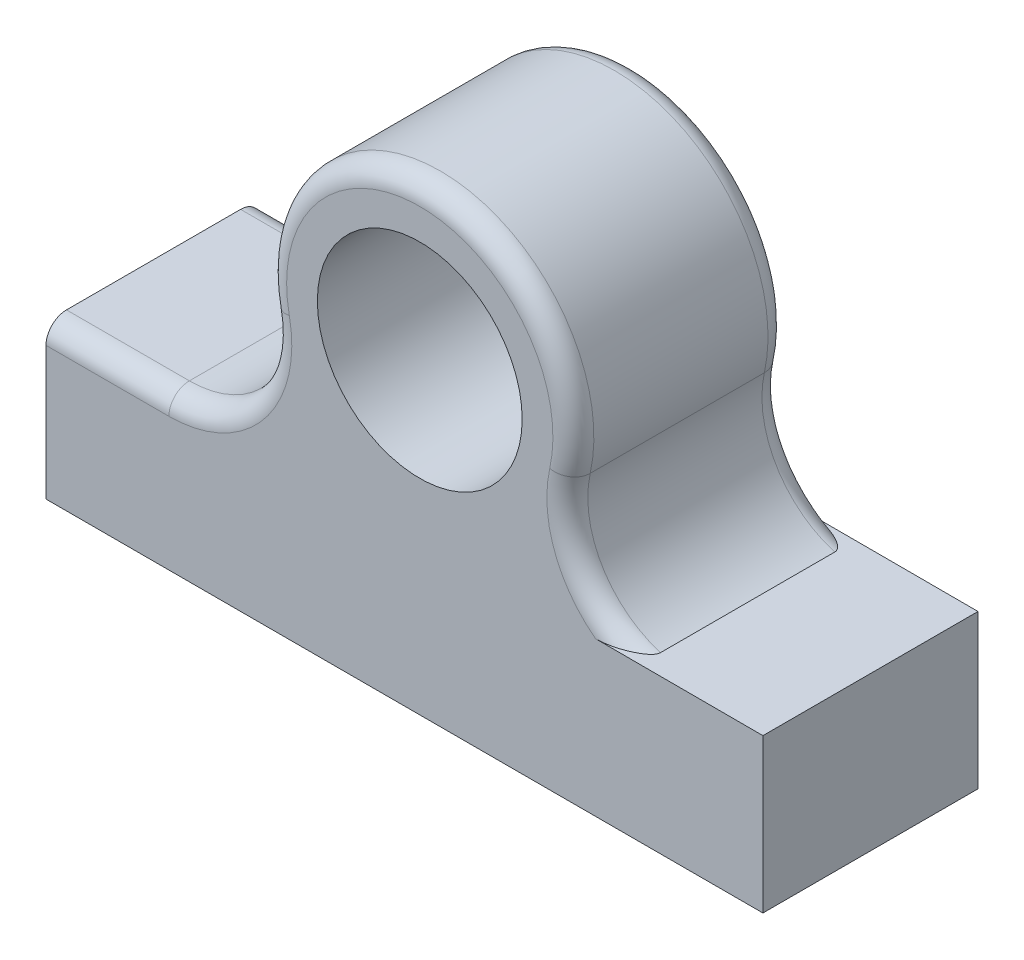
ISO-10303-21;
HEADER;
FILE_DESCRIPTION(('STEP AP214'),'2;1');
FILE_NAME('part.step','',(''),(''),'','','');
FILE_SCHEMA(('AUTOMOTIVE_DESIGN { 1 0 10303 214 1 1 1 1 }'));
ENDSEC;
DATA;
#1=APPLICATION_CONTEXT('core data for automotive mechanical design processes');
#2=APPLICATION_PROTOCOL_DEFINITION('international standard','automotive_design',2000,#1);
#3=PRODUCT_CONTEXT('',#1,'mechanical');
#4=PRODUCT('Part','Part','',(#3));
#5=PRODUCT_RELATED_PRODUCT_CATEGORY('part','',(#4));
#6=PRODUCT_DEFINITION_FORMATION('','',#4);
#7=PRODUCT_DEFINITION_CONTEXT('part definition',#1,'design');
#8=PRODUCT_DEFINITION('design','',#6,#7);
#9=PRODUCT_DEFINITION_SHAPE('','',#8);
#10=(LENGTH_UNIT() NAMED_UNIT(*) SI_UNIT(.MILLI.,.METRE.));
#11=(NAMED_UNIT(*) PLANE_ANGLE_UNIT() SI_UNIT($,.RADIAN.));
#12=(NAMED_UNIT(*) SI_UNIT($,.STERADIAN.) SOLID_ANGLE_UNIT());
#13=UNCERTAINTY_MEASURE_WITH_UNIT(LENGTH_MEASURE(1.E-05),#10,'distance_accuracy_value','');
#14=(GEOMETRIC_REPRESENTATION_CONTEXT(3) GLOBAL_UNCERTAINTY_ASSIGNED_CONTEXT((#13)) GLOBAL_UNIT_ASSIGNED_CONTEXT((#10,
#11,#12)) REPRESENTATION_CONTEXT('',''));
#15=CARTESIAN_POINT('',(0.,0.,0.));
#16=DIRECTION('',(0.,0.,1.));
#17=DIRECTION('',(1.,0.,0.));
#18=AXIS2_PLACEMENT_3D('',#15,#16,#17);
#19=CARTESIAN_POINT('',(-24.4948974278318,28.9977136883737,21.));
#20=DIRECTION('',(0.,0.,1.));
#21=DIRECTION('',(1.,0.,0.));
#22=AXIS2_PLACEMENT_3D('',#19,#20,#21);
#23=PLANE('',#22);
#24=DIRECTION('',(-0.999998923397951,0.00146737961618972,0.));
#25=VECTOR('',#24,1.);
#26=CARTESIAN_POINT('',(33.5051025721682,18.9977136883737,21.));
#27=LINE('',#26,#25);
#28=CARTESIAN_POINT('',(33.5051025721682,18.9977136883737,21.));
#29=VERTEX_POINT('',#28);
#30=CARTESIAN_POINT('',(17.1583536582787,19.0217006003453,21.));
#31=VERTEX_POINT('',#30);
#32=EDGE_CURVE('E49',#29,#31,#27,.T.);
#33=ORIENTED_EDGE('',*,*,#32,.T.);
#34=CARTESIAN_POINT('',(24.4070197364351,28.5850075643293,21.));
#35=DIRECTION('',(0.,0.,1.));
#36=DIRECTION('',(1.,0.,0.));
#37=AXIS2_PLACEMENT_3D('',#34,#35,#36);
#38=CIRCLE('',#37,12.);
#39=CARTESIAN_POINT('',(12.6916502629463,31.1831065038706,21.));
#40=VERTEX_POINT('',#39);
#41=EDGE_CURVE('E186',#31,#40,#38,.F.);
#42=ORIENTED_EDGE('',*,*,#41,.T.);
#43=CARTESIAN_POINT('',(0.,33.9977136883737,21.));
#44=DIRECTION('',(0.,0.,1.));
#45=DIRECTION('',(1.,0.,0.));
#46=AXIS2_PLACEMENT_3D('',#43,#44,#45);
#47=CIRCLE('',#46,13.);
#48=CARTESIAN_POINT('',(-12.7373466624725,31.3977136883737,21.));
#49=VERTEX_POINT('',#48);
#50=EDGE_CURVE('E182',#40,#49,#47,.T.);
#51=ORIENTED_EDGE('',*,*,#50,.T.);
#52=CARTESIAN_POINT('',(-24.4948974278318,28.9977136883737,21.));
#53=DIRECTION('',(0.,0.,1.));
#54=DIRECTION('',(1.,0.,0.));
#55=AXIS2_PLACEMENT_3D('',#52,#53,#54);
#56=CIRCLE('',#55,12.);
#57=CARTESIAN_POINT('',(-24.4948974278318,16.9977136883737,21.));
#58=VERTEX_POINT('',#57);
#59=EDGE_CURVE('E55',#49,#58,#56,.F.);
#60=ORIENTED_EDGE('',*,*,#59,.T.);
#61=DIRECTION('',(-1.,0.,0.));
#62=VECTOR('',#61,1.);
#63=CARTESIAN_POINT('',(-36.4948974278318,16.9977136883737,21.));
#64=LINE('',#63,#62);
#65=CARTESIAN_POINT('',(-36.4948974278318,16.9977136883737,21.));
#66=VERTEX_POINT('',#65);
#67=EDGE_CURVE('E131',#58,#66,#64,.T.);
#68=ORIENTED_EDGE('',*,*,#67,.T.);
#69=DIRECTION('',(0.,-1.,0.));
#70=VECTOR('',#69,1.);
#71=CARTESIAN_POINT('',(-36.4948974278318,3.9977136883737,21.));
#72=LINE('',#71,#70);
#73=CARTESIAN_POINT('',(-36.4948974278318,3.9977136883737,21.));
#74=VERTEX_POINT('',#73);
#75=EDGE_CURVE('E126',#66,#74,#72,.T.);
#76=ORIENTED_EDGE('',*,*,#75,.T.);
#77=DIRECTION('',(1.,0.,0.));
#78=VECTOR('',#77,1.);
#79=CARTESIAN_POINT('',(33.5051025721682,3.99771368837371,21.));
#80=LINE('',#79,#78);
#81=CARTESIAN_POINT('',(33.5051025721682,3.99771368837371,21.));
#82=VERTEX_POINT('',#81);
#83=EDGE_CURVE('E129',#74,#82,#80,.T.);
#84=ORIENTED_EDGE('',*,*,#83,.T.);
#85=DIRECTION('',(0.,1.,0.));
#86=VECTOR('',#85,1.);
#87=CARTESIAN_POINT('',(33.5051025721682,3.99771368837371,21.));
#88=LINE('',#87,#86);
#89=EDGE_CURVE('E144',#82,#29,#88,.T.);
#90=ORIENTED_EDGE('',*,*,#89,.T.);
#91=EDGE_LOOP('',(#33,#42,#51,#60,#68,#76,#84,#90));
#92=FACE_BOUND('',#91,.T.);
#93=CARTESIAN_POINT('',(0.,33.9977136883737,21.));
#94=DIRECTION('',(0.,0.,1.));
#95=DIRECTION('',(1.,0.,0.));
#96=AXIS2_PLACEMENT_3D('',#93,#94,#95);
#97=CIRCLE('',#96,10.);
#98=CARTESIAN_POINT('',(10.,33.9977136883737,21.));
#99=VERTEX_POINT('',#98);
#100=EDGE_CURVE('E308',#99,#99,#97,.T.);
#101=ORIENTED_EDGE('',*,*,#100,.F.);
#102=EDGE_LOOP('',(#101));
#103=FACE_BOUND('',#102,.T.);
#104=ADVANCED_FACE('F32',(#92,#103),#23,.T.);
#105=CARTESIAN_POINT('',(-24.4948974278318,28.9977136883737,0.));
#106=DIRECTION('',(0.,0.,1.));
#107=DIRECTION('',(1.,0.,0.));
#108=AXIS2_PLACEMENT_3D('',#105,#106,#107);
#109=PLANE('',#108);
#110=CARTESIAN_POINT('',(24.4070197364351,28.5850075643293,0.));
#111=DIRECTION('',(0.,0.,1.));
#112=DIRECTION('',(1.,0.,0.));
#113=AXIS2_PLACEMENT_3D('',#110,#111,#112);
#114=CIRCLE('',#113,12.);
#115=CARTESIAN_POINT('',(12.6916502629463,31.1831065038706,0.));
#116=VERTEX_POINT('',#115);
#117=CARTESIAN_POINT('',(17.1583536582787,19.0217006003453,0.));
#118=VERTEX_POINT('',#117);
#119=EDGE_CURVE('E167',#116,#118,#114,.T.);
#120=ORIENTED_EDGE('',*,*,#119,.T.);
#121=DIRECTION('',(-0.999998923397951,0.00146737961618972,0.));
#122=VECTOR('',#121,1.);
#123=CARTESIAN_POINT('',(33.5051025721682,18.9977136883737,0.));
#124=LINE('',#123,#122);
#125=CARTESIAN_POINT('',(33.5051025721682,18.9977136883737,0.));
#126=VERTEX_POINT('',#125);
#127=EDGE_CURVE('E135',#126,#118,#124,.T.);
#128=ORIENTED_EDGE('',*,*,#127,.F.);
#129=DIRECTION('',(0.,1.,0.));
#130=VECTOR('',#129,1.);
#131=CARTESIAN_POINT('',(33.5051025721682,3.99771368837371,0.));
#132=LINE('',#131,#130);
#133=CARTESIAN_POINT('',(33.5051025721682,3.99771368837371,0.));
#134=VERTEX_POINT('',#133);
#135=EDGE_CURVE('E334',#134,#126,#132,.T.);
#136=ORIENTED_EDGE('',*,*,#135,.F.);
#137=DIRECTION('',(1.,0.,0.));
#138=VECTOR('',#137,1.);
#139=CARTESIAN_POINT('',(33.5051025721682,3.99771368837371,0.));
#140=LINE('',#139,#138);
#141=CARTESIAN_POINT('',(-36.4948974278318,3.9977136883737,0.));
#142=VERTEX_POINT('',#141);
#143=EDGE_CURVE('E335',#142,#134,#140,.T.);
#144=ORIENTED_EDGE('',*,*,#143,.F.);
#145=DIRECTION('',(0.,-1.,0.));
#146=VECTOR('',#145,1.);
#147=CARTESIAN_POINT('',(-36.4948974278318,3.9977136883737,0.));
#148=LINE('',#147,#146);
#149=CARTESIAN_POINT('',(-36.4948974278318,16.9977136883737,0.));
#150=VERTEX_POINT('',#149);
#151=EDGE_CURVE('E149',#150,#142,#148,.T.);
#152=ORIENTED_EDGE('',*,*,#151,.F.);
#153=DIRECTION('',(-1.,0.,0.));
#154=VECTOR('',#153,1.);
#155=CARTESIAN_POINT('',(-24.4948974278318,16.9977136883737,0.));
#156=LINE('',#155,#154);
#157=CARTESIAN_POINT('',(-24.4948974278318,16.9977136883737,0.));
#158=VERTEX_POINT('',#157);
#159=EDGE_CURVE('E165',#150,#158,#156,.F.);
#160=ORIENTED_EDGE('',*,*,#159,.T.);
#161=CARTESIAN_POINT('',(-24.4948974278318,28.9977136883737,0.));
#162=DIRECTION('',(0.,0.,1.));
#163=DIRECTION('',(1.,0.,0.));
#164=AXIS2_PLACEMENT_3D('',#161,#162,#163);
#165=CIRCLE('',#164,12.);
#166=CARTESIAN_POINT('',(-12.7373466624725,31.3977136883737,0.));
#167=VERTEX_POINT('',#166);
#168=EDGE_CURVE('E163',#158,#167,#165,.T.);
#169=ORIENTED_EDGE('',*,*,#168,.T.);
#170=CARTESIAN_POINT('',(0.,33.9977136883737,0.));
#171=DIRECTION('',(0.,0.,1.));
#172=DIRECTION('',(1.,0.,0.));
#173=AXIS2_PLACEMENT_3D('',#170,#171,#172);
#174=CIRCLE('',#173,13.);
#175=EDGE_CURVE('E161',#167,#116,#174,.F.);
#176=ORIENTED_EDGE('',*,*,#175,.T.);
#177=EDGE_LOOP('',(#120,#128,#136,#144,#152,#160,#169,#176));
#178=FACE_BOUND('',#177,.T.);
#179=CARTESIAN_POINT('',(0.,33.9977136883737,0.));
#180=DIRECTION('',(0.,0.,1.));
#181=DIRECTION('',(1.,0.,0.));
#182=AXIS2_PLACEMENT_3D('',#179,#180,#181);
#183=CIRCLE('',#182,10.);
#184=CARTESIAN_POINT('',(10.,33.9977136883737,0.));
#185=VERTEX_POINT('',#184);
#186=EDGE_CURVE('E305',#185,#185,#183,.T.);
#187=ORIENTED_EDGE('',*,*,#186,.T.);
#188=EDGE_LOOP('',(#187));
#189=FACE_BOUND('',#188,.T.);
#190=ADVANCED_FACE('F242',(#178,#189),#109,.F.);
#191=CARTESIAN_POINT('',(-36.4948974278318,3.9977136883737,21.));
#192=DIRECTION('',(1.,0.,0.));
#193=DIRECTION('',(0.,0.,-1.));
#194=AXIS2_PLACEMENT_3D('',#191,#192,#193);
#195=PLANE('',#194);
#196=DIRECTION('',(0.,0.,-1.));
#197=VECTOR('',#196,1.);
#198=CARTESIAN_POINT('',(-36.4948974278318,18.9977136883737,21.));
#199=LINE('',#198,#197);
#200=CARTESIAN_POINT('',(-36.4948974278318,18.9977136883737,19.));
#201=VERTEX_POINT('',#200);
#202=CARTESIAN_POINT('',(-36.4948974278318,18.9977136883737,2.));
#203=VERTEX_POINT('',#202);
#204=EDGE_CURVE('E320',#201,#203,#199,.T.);
#205=ORIENTED_EDGE('',*,*,#204,.T.);
#206=CARTESIAN_POINT('',(-36.4948974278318,16.9977136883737,2.));
#207=DIRECTION('',(1.,0.,0.));
#208=DIRECTION('',(0.,0.,-1.));
#209=AXIS2_PLACEMENT_3D('',#206,#207,#208);
#210=CIRCLE('',#209,2.);
#211=EDGE_CURVE('E176',#203,#150,#210,.F.);
#212=ORIENTED_EDGE('',*,*,#211,.T.);
#213=ORIENTED_EDGE('',*,*,#151,.T.);
#214=DIRECTION('',(0.,0.,-1.));
#215=VECTOR('',#214,1.);
#216=CARTESIAN_POINT('',(-36.4948974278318,3.9977136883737,21.));
#217=LINE('',#216,#215);
#218=EDGE_CURVE('E140',#74,#142,#217,.T.);
#219=ORIENTED_EDGE('',*,*,#218,.F.);
#220=ORIENTED_EDGE('',*,*,#75,.F.);
#221=CARTESIAN_POINT('',(-36.4948974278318,16.9977136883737,19.));
#222=DIRECTION('',(1.,0.,0.));
#223=DIRECTION('',(0.,0.,-1.));
#224=AXIS2_PLACEMENT_3D('',#221,#222,#223);
#225=CIRCLE('',#224,2.);
#226=EDGE_CURVE('E174',#66,#201,#225,.F.);
#227=ORIENTED_EDGE('',*,*,#226,.T.);
#228=EDGE_LOOP('',(#205,#212,#213,#219,#220,#227));
#229=FACE_BOUND('',#228,.T.);
#230=ADVANCED_FACE('F147',(#229),#195,.F.);
#231=CARTESIAN_POINT('',(33.5051025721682,3.99771368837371,21.));
#232=DIRECTION('',(0.,1.,0.));
#233=DIRECTION('',(-1.,0.,0.));
#234=AXIS2_PLACEMENT_3D('',#231,#232,#233);
#235=PLANE('',#234);
#236=ORIENTED_EDGE('',*,*,#143,.T.);
#237=DIRECTION('',(0.,0.,-1.));
#238=VECTOR('',#237,1.);
#239=CARTESIAN_POINT('',(33.5051025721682,3.99771368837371,21.));
#240=LINE('',#239,#238);
#241=EDGE_CURVE('E142',#82,#134,#240,.T.);
#242=ORIENTED_EDGE('',*,*,#241,.F.);
#243=ORIENTED_EDGE('',*,*,#83,.F.);
#244=ORIENTED_EDGE('',*,*,#218,.T.);
#245=EDGE_LOOP('',(#236,#242,#243,#244));
#246=FACE_BOUND('',#245,.T.);
#247=ADVANCED_FACE('F139',(#246),#235,.F.);
#248=CARTESIAN_POINT('',(33.5051025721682,3.99771368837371,21.));
#249=DIRECTION('',(-1.,0.,0.));
#250=DIRECTION('',(0.,0.,1.));
#251=AXIS2_PLACEMENT_3D('',#248,#249,#250);
#252=PLANE('',#251);
#253=ORIENTED_EDGE('',*,*,#135,.T.);
#254=DIRECTION('',(0.,0.,-1.));
#255=VECTOR('',#254,1.);
#256=CARTESIAN_POINT('',(33.5051025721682,18.9977136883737,21.));
#257=LINE('',#256,#255);
#258=EDGE_CURVE('E155',#29,#126,#257,.T.);
#259=ORIENTED_EDGE('',*,*,#258,.F.);
#260=ORIENTED_EDGE('',*,*,#89,.F.);
#261=ORIENTED_EDGE('',*,*,#241,.T.);
#262=EDGE_LOOP('',(#253,#259,#260,#261));
#263=FACE_BOUND('',#262,.T.);
#264=ADVANCED_FACE('F268',(#263),#252,.F.);
#265=CARTESIAN_POINT('',(33.5051025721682,18.9977136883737,21.));
#266=DIRECTION('',(-0.00146737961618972,-0.999998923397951,0.));
#267=DIRECTION('',(0.999998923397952,-0.00146737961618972,0.));
#268=AXIS2_PLACEMENT_3D('',#265,#266,#267);
#269=PLANE('',#268);
#270=ORIENTED_EDGE('',*,*,#127,.T.);
#271=CARTESIAN_POINT('',(17.1583536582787,19.0217006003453,0.));
#272=CARTESIAN_POINT('',(17.2427038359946,19.0215768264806,4.35707837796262E-06));
#273=CARTESIAN_POINT('',(17.3270357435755,19.0214530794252,0.00193903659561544));
#274=CARTESIAN_POINT('',(17.4955185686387,19.0212058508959,0.00944230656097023));
#275=CARTESIAN_POINT('',(17.5796695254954,19.0210823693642,0.0150100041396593));
#276=CARTESIAN_POINT('',(17.8315297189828,19.0207127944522,0.0368097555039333));
#277=CARTESIAN_POINT('',(17.998814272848,19.0204673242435,0.0581393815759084));
#278=CARTESIAN_POINT('',(18.3331189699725,19.0199767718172,0.113237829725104));
#279=CARTESIAN_POINT('',(18.5001169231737,19.0197317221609,0.147137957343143));
#280=CARTESIAN_POINT('',(18.8314214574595,19.0192455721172,0.226279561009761));
#281=CARTESIAN_POINT('',(18.995727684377,19.0190044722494,0.271522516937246));
#282=CARTESIAN_POINT('',(19.2917327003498,19.0185701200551,0.363644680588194));
#283=CARTESIAN_POINT('',(19.4239821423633,19.0183760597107,0.408766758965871));
#284=CARTESIAN_POINT('',(19.6858294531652,19.0179918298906,0.506234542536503));
#285=CARTESIAN_POINT('',(19.8154267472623,19.0178016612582,0.55858179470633));
#286=CARTESIAN_POINT('',(20.0707078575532,19.0174270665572,0.670612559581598));
#287=CARTESIAN_POINT('',(20.196407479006,19.0172426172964,0.730259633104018));
#288=CARTESIAN_POINT('',(20.3815494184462,19.0169709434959,0.826186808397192));
#289=CARTESIAN_POINT('',(20.4426772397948,19.0168812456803,0.859227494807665));
#290=CARTESIAN_POINT('',(20.5635549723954,19.0167038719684,0.927732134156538));
#291=CARTESIAN_POINT('',(20.6233050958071,19.0166161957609,0.963195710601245));
#292=CARTESIAN_POINT('',(20.7500533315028,19.0164302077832,1.04253529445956));
#293=CARTESIAN_POINT('',(20.8167670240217,19.0163323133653,1.08686940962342));
#294=CARTESIAN_POINT('',(20.9471349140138,19.016141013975,1.18024271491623));
#295=CARTESIAN_POINT('',(21.010780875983,19.0160476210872,1.22929361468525));
#296=CARTESIAN_POINT('',(21.1337013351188,19.0158672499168,1.33388652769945));
#297=CARTESIAN_POINT('',(21.1929236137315,19.0157803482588,1.38949061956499));
#298=CARTESIAN_POINT('',(21.3025356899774,19.0156195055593,1.50891980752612));
#299=CARTESIAN_POINT('',(21.3529643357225,19.0155455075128,1.57270646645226));
#300=CARTESIAN_POINT('',(21.4153257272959,19.0154539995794,1.67511306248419));
#301=CARTESIAN_POINT('',(21.4336997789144,19.0154270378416,1.70974851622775));
#302=CARTESIAN_POINT('',(21.4649332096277,19.0153812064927,1.78134390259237));
#303=CARTESIAN_POINT('',(21.4778158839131,19.0153623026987,1.81829323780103));
#304=CARTESIAN_POINT('',(21.493026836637,19.0153399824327,1.87954820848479));
#305=CARTESIAN_POINT('',(21.4975054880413,19.0153334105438,1.90332375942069));
#306=CARTESIAN_POINT('',(21.5035664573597,19.0153245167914,1.95138730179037));
#307=CARTESIAN_POINT('',(21.5051306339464,19.0153222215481,1.9756775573));
#308=CARTESIAN_POINT('',(21.5051025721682,19.0153222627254,2.));
#309=B_SPLINE_CURVE_WITH_KNOTS('',3,(#271,#272,#273,#274,#275,#276,#277,#278,#279,#280,#281,
#282,#283,#284,#285,#286,#287,#288,#289,#290,#291,#292,#293,#294,#295,#296,#297,#298,#299,#300,
#301,#302,#303,#304,#305,#306,#307,#308),.UNSPECIFIED.,.F.,.F.,(4,2,2,2,2,2,2,2,2,2,2,2,2,2,2,2,
2,2,4),(0.,0.252998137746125,0.5059341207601,1.0113036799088,1.52210803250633,2.0329790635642,
2.45198649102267,2.87108377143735,3.28816836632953,3.49658274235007,3.70496480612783,
3.94512844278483,4.1859044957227,4.42917918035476,4.67135029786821,4.7886389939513,
4.90542506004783,4.97783842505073,5.05070104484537),.UNSPECIFIED.);
#310=CARTESIAN_POINT('',(21.5051025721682,19.0153222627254,2.));
#311=VERTEX_POINT('',#310);
#312=EDGE_CURVE('E41',#118,#311,#309,.T.);
#313=ORIENTED_EDGE('',*,*,#312,.T.);
#314=DIRECTION('',(0.,0.,-1.));
#315=VECTOR('',#314,1.);
#316=CARTESIAN_POINT('',(21.5051025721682,19.0153222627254,21.));
#317=LINE('',#316,#315);
#318=CARTESIAN_POINT('',(21.5051025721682,19.0153222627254,19.));
#319=VERTEX_POINT('',#318);
#320=EDGE_CURVE('E272',#319,#311,#317,.T.);
#321=ORIENTED_EDGE('',*,*,#320,.F.);
#322=CARTESIAN_POINT('',(21.5051025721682,19.0153222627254,19.));
#323=CARTESIAN_POINT('',(21.5051148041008,19.0153222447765,19.0202559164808));
#324=CARTESIAN_POINT('',(21.5040361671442,19.0153238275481,19.0404955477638));
#325=CARTESIAN_POINT('',(21.4998113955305,19.0153300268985,19.0807148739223));
#326=CARTESIAN_POINT('',(21.4966697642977,19.0153346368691,19.1006950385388));
#327=CARTESIAN_POINT('',(21.4844705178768,19.0153525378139,19.1592856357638));
#328=CARTESIAN_POINT('',(21.4726291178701,19.0153699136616,19.1973297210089));
#329=CARTESIAN_POINT('',(21.4384673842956,19.0154200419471,19.2823273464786));
#330=CARTESIAN_POINT('',(21.4140398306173,19.01545588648,19.3284020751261));
#331=CARTESIAN_POINT('',(21.3583167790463,19.0155376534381,19.4165405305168));
#332=CARTESIAN_POINT('',(21.3269649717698,19.0155836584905,19.4585670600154));
#333=CARTESIAN_POINT('',(21.2522411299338,19.0156933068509,19.5479581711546));
#334=CARTESIAN_POINT('',(21.2077552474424,19.0157585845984,19.5943737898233));
#335=CARTESIAN_POINT('',(21.1145713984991,19.0158953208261,19.6828227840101));
#336=CARTESIAN_POINT('',(21.0658657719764,19.0159667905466,19.7248478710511));
#337=CARTESIAN_POINT('',(20.9654358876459,19.0161141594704,19.8055334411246));
#338=CARTESIAN_POINT('',(20.9136998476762,19.0161900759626,19.8441791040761));
#339=CARTESIAN_POINT('',(20.8082366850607,19.0163448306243,19.9185306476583));
#340=CARTESIAN_POINT('',(20.7545111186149,19.0164236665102,19.9542387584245));
#341=CARTESIAN_POINT('',(20.6237374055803,19.0166155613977,20.0369968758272));
#342=CARTESIAN_POINT('',(20.5459500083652,19.0167297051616,20.0828758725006));
#343=CARTESIAN_POINT('',(20.3881528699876,19.0169612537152,20.170667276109));
#344=CARTESIAN_POINT('',(20.308142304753,19.0170786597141,20.2125781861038));
#345=CARTESIAN_POINT('',(20.1462711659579,19.0173161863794,20.2929528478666));
#346=CARTESIAN_POINT('',(20.0644081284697,19.0174363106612,20.3314116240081));
#347=CARTESIAN_POINT('',(19.8992363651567,19.0176786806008,20.4050976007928));
#348=CARTESIAN_POINT('',(19.815927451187,19.0178009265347,20.4403243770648));
#349=CARTESIAN_POINT('',(19.5643670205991,19.0181700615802,20.5413168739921));
#350=CARTESIAN_POINT('',(19.3942575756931,19.0184196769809,20.6025043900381));
#351=CARTESIAN_POINT('',(19.0503444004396,19.0189243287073,20.7128122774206));
#352=CARTESIAN_POINT('',(18.8765440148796,19.0191793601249,20.761943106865));
#353=CARTESIAN_POINT('',(18.5747304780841,19.0196222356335,20.8356003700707));
#354=CARTESIAN_POINT('',(18.4474554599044,19.0198089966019,20.8631679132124));
#355=CARTESIAN_POINT('',(18.1915866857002,19.0201844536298,20.9112569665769));
#356=CARTESIAN_POINT('',(18.0629930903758,19.0203731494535,20.9317793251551));
#357=CARTESIAN_POINT('',(17.8053778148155,19.0207511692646,20.9651291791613));
#358=CARTESIAN_POINT('',(17.6763606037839,19.0209404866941,20.9779905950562));
#359=CARTESIAN_POINT('',(17.4176983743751,19.0213200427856,20.9954154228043));
#360=CARTESIAN_POINT('',(17.2880530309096,19.0215102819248,20.9999739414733));
#361=CARTESIAN_POINT('',(17.1583536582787,19.0217006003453,21.));
#362=B_SPLINE_CURVE_WITH_KNOTS('',3,(#322,#323,#324,#325,#326,#327,#328,#329,#330,#331,#332,
#333,#334,#335,#336,#337,#338,#339,#340,#341,#342,#343,#344,#345,#346,#347,#348,#349,#350,#351,
#352,#353,#354,#355,#356,#357,#358,#359,#360,#361),.UNSPECIFIED.,.F.,.F.,(4,2,2,2,2,2,2,2,2,2,2,
2,2,2,2,2,2,2,2,4),(0.,0.0607105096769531,0.121288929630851,0.240138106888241,0.395706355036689,
0.55258962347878,0.745029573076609,0.93782648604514,1.13143041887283,1.32488598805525,
1.59566164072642,1.86653903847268,2.13780078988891,2.4090981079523,2.95094579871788,
3.49232180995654,3.88282355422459,4.27327825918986,4.6619910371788,5.05093282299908),.UNSPECIFIED.);
#363=EDGE_CURVE('E11',#319,#31,#362,.T.);
#364=ORIENTED_EDGE('',*,*,#363,.T.);
#365=ORIENTED_EDGE('',*,*,#32,.F.);
#366=ORIENTED_EDGE('',*,*,#258,.T.);
#367=EDGE_LOOP('',(#270,#313,#321,#364,#365,#366));
#368=FACE_BOUND('',#367,.T.);
#369=ADVANCED_FACE('F202',(#368),#269,.F.);
#370=CARTESIAN_POINT('',(24.4070197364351,28.5850075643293,21.));
#371=DIRECTION('',(0.,0.,-1.));
#372=DIRECTION('',(-1.,0.,0.));
#373=AXIS2_PLACEMENT_3D('',#370,#371,#372);
#374=CYLINDRICAL_SURFACE('',#373,9.99999999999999);
#375=ORIENTED_EDGE('',*,*,#320,.T.);
#376=CARTESIAN_POINT('',(24.4070197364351,28.5850075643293,2.));
#377=DIRECTION('',(0.,0.,1.));
#378=DIRECTION('',(1.,0.,0.));
#379=AXIS2_PLACEMENT_3D('',#376,#377,#378);
#380=CIRCLE('',#379,9.99999999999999);
#381=CARTESIAN_POINT('',(14.6442118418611,30.7500900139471,2.));
#382=VERTEX_POINT('',#381);
#383=EDGE_CURVE('E153',#311,#382,#380,.F.);
#384=ORIENTED_EDGE('',*,*,#383,.T.);
#385=DIRECTION('',(0.,0.,-1.));
#386=VECTOR('',#385,1.);
#387=CARTESIAN_POINT('',(14.6442118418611,30.7500900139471,21.));
#388=LINE('',#387,#386);
#389=CARTESIAN_POINT('',(14.6442118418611,30.7500900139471,19.));
#390=VERTEX_POINT('',#389);
#391=EDGE_CURVE('E278',#390,#382,#388,.T.);
#392=ORIENTED_EDGE('',*,*,#391,.F.);
#393=CARTESIAN_POINT('',(24.4070197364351,28.5850075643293,19.));
#394=DIRECTION('',(0.,0.,1.));
#395=DIRECTION('',(1.,0.,0.));
#396=AXIS2_PLACEMENT_3D('',#393,#394,#395);
#397=CIRCLE('',#396,9.99999999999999);
#398=EDGE_CURVE('E151',#390,#319,#397,.T.);
#399=ORIENTED_EDGE('',*,*,#398,.T.);
#400=EDGE_LOOP('',(#375,#384,#392,#399));
#401=FACE_BOUND('',#400,.T.);
#402=ADVANCED_FACE('F261',(#401),#374,.F.);
#403=CARTESIAN_POINT('',(0.,33.9977136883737,21.));
#404=DIRECTION('',(0.,0.,-1.));
#405=DIRECTION('',(-1.,0.,0.));
#406=AXIS2_PLACEMENT_3D('',#403,#404,#405);
#407=CYLINDRICAL_SURFACE('',#406,15.);
#408=ORIENTED_EDGE('',*,*,#391,.T.);
#409=CARTESIAN_POINT('',(0.,33.9977136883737,2.));
#410=DIRECTION('',(0.,0.,1.));
#411=DIRECTION('',(1.,0.,0.));
#412=AXIS2_PLACEMENT_3D('',#409,#410,#411);
#413=CIRCLE('',#412,15.);
#414=CARTESIAN_POINT('',(-14.6969384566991,30.9977136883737,2.));
#415=VERTEX_POINT('',#414);
#416=EDGE_CURVE('E190',#382,#415,#413,.T.);
#417=ORIENTED_EDGE('',*,*,#416,.T.);
#418=DIRECTION('',(0.,0.,-1.));
#419=VECTOR('',#418,1.);
#420=CARTESIAN_POINT('',(-14.6969384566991,30.9977136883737,21.));
#421=LINE('',#420,#419);
#422=CARTESIAN_POINT('',(-14.6969384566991,30.9977136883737,19.));
#423=VERTEX_POINT('',#422);
#424=EDGE_CURVE('E291',#423,#415,#421,.T.);
#425=ORIENTED_EDGE('',*,*,#424,.F.);
#426=CARTESIAN_POINT('',(0.,33.9977136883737,19.));
#427=DIRECTION('',(0.,0.,1.));
#428=DIRECTION('',(1.,0.,0.));
#429=AXIS2_PLACEMENT_3D('',#426,#427,#428);
#430=CIRCLE('',#429,15.);
#431=EDGE_CURVE('E188',#423,#390,#430,.F.);
#432=ORIENTED_EDGE('',*,*,#431,.T.);
#433=EDGE_LOOP('',(#408,#417,#425,#432));
#434=FACE_BOUND('',#433,.T.);
#435=ADVANCED_FACE('F258',(#434),#407,.T.);
#436=CARTESIAN_POINT('',(-24.4948974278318,28.9977136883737,21.));
#437=DIRECTION('',(0.,0.,-1.));
#438=DIRECTION('',(-1.,0.,0.));
#439=AXIS2_PLACEMENT_3D('',#436,#437,#438);
#440=CYLINDRICAL_SURFACE('',#439,10.);
#441=ORIENTED_EDGE('',*,*,#424,.T.);
#442=CARTESIAN_POINT('',(-24.4948974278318,28.9977136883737,2.));
#443=DIRECTION('',(0.,0.,1.));
#444=DIRECTION('',(1.,0.,0.));
#445=AXIS2_PLACEMENT_3D('',#442,#443,#444);
#446=CIRCLE('',#445,10.);
#447=CARTESIAN_POINT('',(-24.4948974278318,18.9977136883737,2.));
#448=VERTEX_POINT('',#447);
#449=EDGE_CURVE('E180',#415,#448,#446,.F.);
#450=ORIENTED_EDGE('',*,*,#449,.T.);
#451=DIRECTION('',(0.,0.,-1.));
#452=VECTOR('',#451,1.);
#453=CARTESIAN_POINT('',(-24.4948974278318,18.9977136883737,21.));
#454=LINE('',#453,#452);
#455=CARTESIAN_POINT('',(-24.4948974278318,18.9977136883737,19.));
#456=VERTEX_POINT('',#455);
#457=EDGE_CURVE('E297',#456,#448,#454,.T.);
#458=ORIENTED_EDGE('',*,*,#457,.F.);
#459=CARTESIAN_POINT('',(-24.4948974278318,28.9977136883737,19.));
#460=DIRECTION('',(0.,0.,1.));
#461=DIRECTION('',(1.,0.,0.));
#462=AXIS2_PLACEMENT_3D('',#459,#460,#461);
#463=CIRCLE('',#462,10.);
#464=EDGE_CURVE('E178',#456,#423,#463,.T.);
#465=ORIENTED_EDGE('',*,*,#464,.T.);
#466=EDGE_LOOP('',(#441,#450,#458,#465));
#467=FACE_BOUND('',#466,.T.);
#468=ADVANCED_FACE('F254',(#467),#440,.F.);
#469=CARTESIAN_POINT('',(-36.4948974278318,18.9977136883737,21.));
#470=DIRECTION('',(0.,-1.,0.));
#471=DIRECTION('',(1.,0.,0.));
#472=AXIS2_PLACEMENT_3D('',#469,#470,#471);
#473=PLANE('',#472);
#474=ORIENTED_EDGE('',*,*,#457,.T.);
#475=DIRECTION('',(-1.,0.,0.));
#476=VECTOR('',#475,1.);
#477=CARTESIAN_POINT('',(-36.4948974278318,18.9977136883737,2.));
#478=LINE('',#477,#476);
#479=EDGE_CURVE('E172',#448,#203,#478,.T.);
#480=ORIENTED_EDGE('',*,*,#479,.T.);
#481=ORIENTED_EDGE('',*,*,#204,.F.);
#482=DIRECTION('',(-1.,0.,0.));
#483=VECTOR('',#482,1.);
#484=CARTESIAN_POINT('',(-24.4948974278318,18.9977136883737,19.));
#485=LINE('',#484,#483);
#486=EDGE_CURVE('E170',#201,#456,#485,.F.);
#487=ORIENTED_EDGE('',*,*,#486,.T.);
#488=EDGE_LOOP('',(#474,#480,#481,#487));
#489=FACE_BOUND('',#488,.T.);
#490=ADVANCED_FACE('F251',(#489),#473,.F.);
#491=CARTESIAN_POINT('',(0.,33.9977136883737,21.));
#492=DIRECTION('',(0.,0.,-1.));
#493=DIRECTION('',(-1.,0.,0.));
#494=AXIS2_PLACEMENT_3D('',#491,#492,#493);
#495=CYLINDRICAL_SURFACE('',#494,10.);
#496=ORIENTED_EDGE('',*,*,#100,.T.);
#497=EDGE_LOOP('',(#496));
#498=FACE_BOUND('',#497,.T.);
#499=ORIENTED_EDGE('',*,*,#186,.F.);
#500=EDGE_LOOP('',(#499));
#501=FACE_BOUND('',#500,.T.);
#502=ADVANCED_FACE('F223',(#498,#501),#495,.F.);
#503=CARTESIAN_POINT('',(-36.4948974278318,16.9977136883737,2.));
#504=DIRECTION('',(-1.,0.,0.));
#505=DIRECTION('',(0.,-1.,0.));
#506=AXIS2_PLACEMENT_3D('',#503,#504,#505);
#507=CYLINDRICAL_SURFACE('',#506,2.);
#508=ORIENTED_EDGE('',*,*,#211,.F.);
#509=ORIENTED_EDGE('',*,*,#479,.F.);
#510=CARTESIAN_POINT('',(-24.4948974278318,16.9977136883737,2.));
#511=DIRECTION('',(1.,0.,0.));
#512=DIRECTION('',(0.,0.,-1.));
#513=AXIS2_PLACEMENT_3D('',#510,#511,#512);
#514=CIRCLE('',#513,2.);
#515=EDGE_CURVE('E302',#158,#448,#514,.T.);
#516=ORIENTED_EDGE('',*,*,#515,.F.);
#517=ORIENTED_EDGE('',*,*,#159,.F.);
#518=EDGE_LOOP('',(#508,#509,#516,#517));
#519=FACE_BOUND('',#518,.T.);
#520=ADVANCED_FACE('F220',(#519),#507,.T.);
#521=CARTESIAN_POINT('',(-24.4948974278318,28.9977136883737,2.));
#522=DIRECTION('',(0.,0.,1.));
#523=DIRECTION('',(1.,0.,0.));
#524=AXIS2_PLACEMENT_3D('',#521,#522,#523);
#525=TOROIDAL_SURFACE('',#524,12.,2.);
#526=ORIENTED_EDGE('',*,*,#515,.T.);
#527=ORIENTED_EDGE('',*,*,#449,.F.);
#528=CARTESIAN_POINT('',(-12.7373466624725,31.3977136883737,2.));
#529=DIRECTION('',(-0.200000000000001,0.979795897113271,0.));
#530=DIRECTION('',(-0.979795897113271,-0.200000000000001,0.));
#531=AXIS2_PLACEMENT_3D('',#528,#529,#530);
#532=CIRCLE('',#531,2.);
#533=EDGE_CURVE('E286',#167,#415,#532,.T.);
#534=ORIENTED_EDGE('',*,*,#533,.F.);
#535=ORIENTED_EDGE('',*,*,#168,.F.);
#536=EDGE_LOOP('',(#526,#527,#534,#535));
#537=FACE_BOUND('',#536,.T.);
#538=ADVANCED_FACE('F216',(#537),#525,.T.);
#539=CARTESIAN_POINT('',(0.,33.9977136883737,2.));
#540=DIRECTION('',(0.,0.,1.));
#541=DIRECTION('',(1.,0.,0.));
#542=AXIS2_PLACEMENT_3D('',#539,#540,#541);
#543=TOROIDAL_SURFACE('',#542,13.,2.);
#544=ORIENTED_EDGE('',*,*,#533,.T.);
#545=ORIENTED_EDGE('',*,*,#416,.F.);
#546=CARTESIAN_POINT('',(12.6916502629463,31.1831065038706,2.));
#547=DIRECTION('',(-0.216508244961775,-0.976280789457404,0.));
#548=DIRECTION('',(0.976280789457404,-0.216508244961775,0.));
#549=AXIS2_PLACEMENT_3D('',#546,#547,#548);
#550=CIRCLE('',#549,2.);
#551=EDGE_CURVE('E283',#116,#382,#550,.T.);
#552=ORIENTED_EDGE('',*,*,#551,.F.);
#553=ORIENTED_EDGE('',*,*,#175,.F.);
#554=EDGE_LOOP('',(#544,#545,#552,#553));
#555=FACE_BOUND('',#554,.T.);
#556=ADVANCED_FACE('F211',(#555),#543,.T.);
#557=CARTESIAN_POINT('',(24.4070197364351,28.5850075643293,2.));
#558=DIRECTION('',(0.,0.,1.));
#559=DIRECTION('',(1.,0.,0.));
#560=AXIS2_PLACEMENT_3D('',#557,#558,#559);
#561=TOROIDAL_SURFACE('',#560,12.,2.);
#562=ORIENTED_EDGE('',*,*,#312,.F.);
#563=ORIENTED_EDGE('',*,*,#119,.F.);
#564=ORIENTED_EDGE('',*,*,#551,.T.);
#565=ORIENTED_EDGE('',*,*,#383,.F.);
#566=EDGE_LOOP('',(#562,#563,#564,#565));
#567=FACE_BOUND('',#566,.T.);
#568=ADVANCED_FACE('F206',(#567),#561,.T.);
#569=CARTESIAN_POINT('',(-24.4948974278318,16.9977136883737,19.));
#570=DIRECTION('',(1.,0.,0.));
#571=DIRECTION('',(0.,1.,0.));
#572=AXIS2_PLACEMENT_3D('',#569,#570,#571);
#573=CYLINDRICAL_SURFACE('',#572,2.);
#574=ORIENTED_EDGE('',*,*,#226,.F.);
#575=ORIENTED_EDGE('',*,*,#67,.F.);
#576=CARTESIAN_POINT('',(-24.4948974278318,16.9977136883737,19.));
#577=DIRECTION('',(1.,0.,0.));
#578=DIRECTION('',(0.,0.,-1.));
#579=AXIS2_PLACEMENT_3D('',#576,#577,#578);
#580=CIRCLE('',#579,2.);
#581=EDGE_CURVE('E36',#456,#58,#580,.T.);
#582=ORIENTED_EDGE('',*,*,#581,.F.);
#583=ORIENTED_EDGE('',*,*,#486,.F.);
#584=EDGE_LOOP('',(#574,#575,#582,#583));
#585=FACE_BOUND('',#584,.T.);
#586=ADVANCED_FACE('F34',(#585),#573,.T.);
#587=CARTESIAN_POINT('',(-24.4948974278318,28.9977136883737,19.));
#588=DIRECTION('',(0.,0.,1.));
#589=DIRECTION('',(1.,0.,0.));
#590=AXIS2_PLACEMENT_3D('',#587,#588,#589);
#591=TOROIDAL_SURFACE('',#590,12.,2.);
#592=ORIENTED_EDGE('',*,*,#581,.T.);
#593=ORIENTED_EDGE('',*,*,#59,.F.);
#594=CARTESIAN_POINT('',(-12.7373466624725,31.3977136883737,19.));
#595=DIRECTION('',(-0.200000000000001,0.979795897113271,0.));
#596=DIRECTION('',(-0.979795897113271,-0.200000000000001,0.));
#597=AXIS2_PLACEMENT_3D('',#594,#595,#596);
#598=CIRCLE('',#597,2.);
#599=EDGE_CURVE('E313',#423,#49,#598,.T.);
#600=ORIENTED_EDGE('',*,*,#599,.F.);
#601=ORIENTED_EDGE('',*,*,#464,.F.);
#602=EDGE_LOOP('',(#592,#593,#600,#601));
#603=FACE_BOUND('',#602,.T.);
#604=ADVANCED_FACE('F232',(#603),#591,.T.);
#605=CARTESIAN_POINT('',(0.,33.9977136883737,19.));
#606=DIRECTION('',(0.,0.,1.));
#607=DIRECTION('',(1.,0.,0.));
#608=AXIS2_PLACEMENT_3D('',#605,#606,#607);
#609=TOROIDAL_SURFACE('',#608,13.,2.);
#610=ORIENTED_EDGE('',*,*,#599,.T.);
#611=ORIENTED_EDGE('',*,*,#50,.F.);
#612=CARTESIAN_POINT('',(12.6916502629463,31.1831065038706,19.));
#613=DIRECTION('',(-0.216508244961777,-0.976280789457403,0.));
#614=DIRECTION('',(0.976280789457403,-0.216508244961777,0.));
#615=AXIS2_PLACEMENT_3D('',#612,#613,#614);
#616=CIRCLE('',#615,2.);
#617=EDGE_CURVE('E312',#390,#40,#616,.T.);
#618=ORIENTED_EDGE('',*,*,#617,.F.);
#619=ORIENTED_EDGE('',*,*,#431,.F.);
#620=EDGE_LOOP('',(#610,#611,#618,#619));
#621=FACE_BOUND('',#620,.T.);
#622=ADVANCED_FACE('F229',(#621),#609,.T.);
#623=CARTESIAN_POINT('',(24.4070197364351,28.5850075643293,19.));
#624=DIRECTION('',(0.,0.,1.));
#625=DIRECTION('',(1.,0.,0.));
#626=AXIS2_PLACEMENT_3D('',#623,#624,#625);
#627=TOROIDAL_SURFACE('',#626,12.,2.);
#628=ORIENTED_EDGE('',*,*,#363,.F.);
#629=ORIENTED_EDGE('',*,*,#398,.F.);
#630=ORIENTED_EDGE('',*,*,#617,.T.);
#631=ORIENTED_EDGE('',*,*,#41,.F.);
#632=EDGE_LOOP('',(#628,#629,#630,#631));
#633=FACE_BOUND('',#632,.T.);
#634=ADVANCED_FACE('F225',(#633),#627,.T.);
#635=CLOSED_SHELL('',(#104,#190,#230,#247,#264,#369,#402,#435,#468,#490,#502,#520,#538,#556,
#568,#586,#604,#622,#634));
#636=MANIFOLD_SOLID_BREP('B2',#635);
#637=ADVANCED_BREP_SHAPE_REPRESENTATION('',(#18,#636),#14);
#638=SHAPE_DEFINITION_REPRESENTATION(#9,#637);
ENDSEC;
END-ISO-10303-21;
